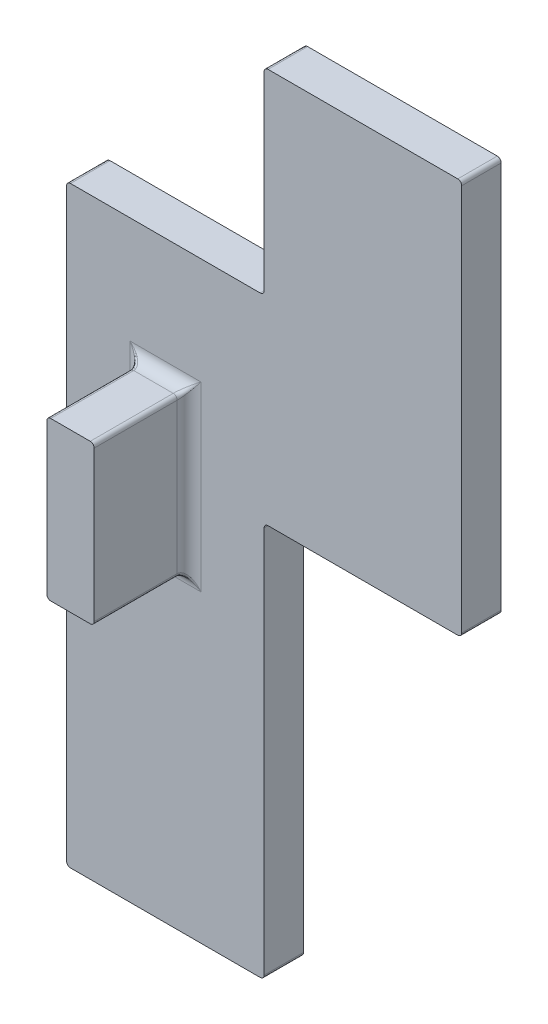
from build123d import *

# Parameters (mm, degrees)
AUFSATZ_LINEAR_AUSTRAGEN1_DEPTH = 5
SCHNITT_LINEAR_START            = -0.8
SKIZZE2_R                       = 2.7
SCHNITT_LINEAR_AUSTRAGEN1_DEPTH = 2.9
VERRUNDUNG1_R                   = 0.5
SKIZZE3_W                       = 6
SKIZZE3_H                       = 20
AUFSATZ_LINEAR_AUSTRAGEN2_DEPTH = 12
VERRUNDUNG2_R                   = 1.5
VERRUNDUNG3_R                   = 0.5


with BuildPart() as part:
    # Skizze1 → Aufsatz-Linear austragen1 (new body)
    with BuildSketch(Plane.XY):
        Polygon((0, 0), (0, 75), (25, 75), (25, 100), (50, 100), (50, 50), (25, 50), (25, 0), align=None)
    extrude(amount=AUFSATZ_LINEAR_AUSTRAGEN1_DEPTH)

    # Skizze2 → Schnitt-Linear austragen1 (cut)
    with BuildSketch(Plane(origin=(0, 0, 0), x_dir=(-1, 0, 0), z_dir=(0, 0, -1)).offset(SCHNITT_LINEAR_START)):
        with Locations((-37.5, 62.5)):
            Circle(SKIZZE2_R)
    extrude(amount=-SCHNITT_LINEAR_AUSTRAGEN1_DEPTH, mode=Mode.SUBTRACT)

    # Verrundung1
    verrundung1_edges = [part.edges().sort_by_distance(p)[0] for p in [
        (0, 0, 2.5),
        (0, 75, 2.5),
        (25, 75, 2.5),
        (25, 100, 2.5),
        (50, 100, 2.5),
        (50, 50, 2.5),
        (25, 50, 2.5),
        (25, 0, 2.5),
    ]]
    fillet(verrundung1_edges, radius=VERRUNDUNG1_R)

    # Skizze3 → Aufsatz-Linear austragen2 (add)
    with BuildSketch(Plane.XY.offset(5)):
        with Locations((12.5, 50)):
            Rectangle(SKIZZE3_W, SKIZZE3_H)
    extrude(amount=AUFSATZ_LINEAR_AUSTRAGEN2_DEPTH)

    # Verrundung2
    verrundung2_edges = [part.edges().sort_by_distance(p)[0] for p in [
        (9.5, 50, 5),
        (12.5, 40, 5),
        (15.5, 50, 5),
        (12.5, 60, 5),
    ]]
    fillet(verrundung2_edges, radius=VERRUNDUNG2_R)

    # Verrundung3
    verrundung3_edges = [part.edges().sort_by_distance(p)[0] for p in [
        (16.030926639, 39.469073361, 5.355055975),
        (8.969073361, 39.469073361, 5.355055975),
        (16.030926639, 60.530926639, 5.355055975),
        (8.969073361, 60.530926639, 5.355055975),
        (9.5, 60, 11.75),
        (9.5, 40, 11.75),
        (15.5, 40, 11.75),
        (15.5, 60, 11.75),
    ]]
    fillet(verrundung3_edges, radius=VERRUNDUNG3_R)


solid = part.part
